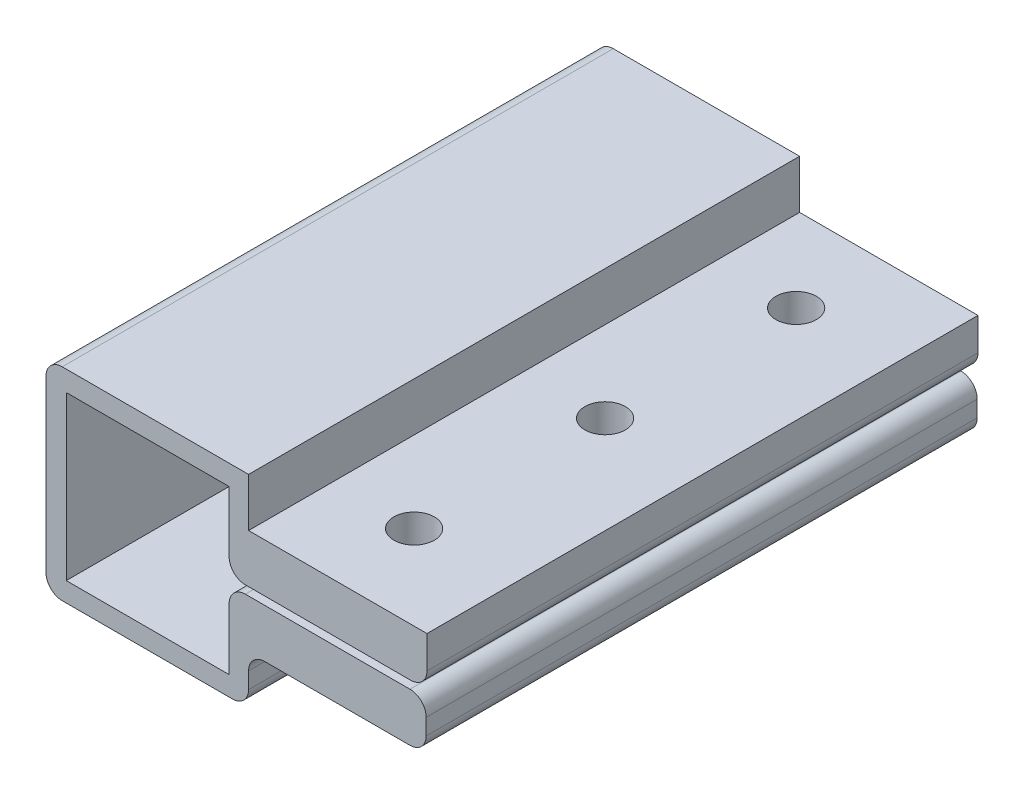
ISO-10303-21;
HEADER;
FILE_DESCRIPTION(('STEP AP214'),'2;1');
FILE_NAME('part.step','',(''),(''),'','','');
FILE_SCHEMA(('AUTOMOTIVE_DESIGN { 1 0 10303 214 1 1 1 1 }'));
ENDSEC;
DATA;
#1=APPLICATION_CONTEXT('core data for automotive mechanical design processes');
#2=APPLICATION_PROTOCOL_DEFINITION('international standard','automotive_design',2000,#1);
#3=PRODUCT_CONTEXT('',#1,'mechanical');
#4=PRODUCT('Part','Part','',(#3));
#5=PRODUCT_RELATED_PRODUCT_CATEGORY('part','',(#4));
#6=PRODUCT_DEFINITION_FORMATION('','',#4);
#7=PRODUCT_DEFINITION_CONTEXT('part definition',#1,'design');
#8=PRODUCT_DEFINITION('design','',#6,#7);
#9=PRODUCT_DEFINITION_SHAPE('','',#8);
#10=(LENGTH_UNIT() NAMED_UNIT(*) SI_UNIT(.MILLI.,.METRE.));
#11=(NAMED_UNIT(*) PLANE_ANGLE_UNIT() SI_UNIT($,.RADIAN.));
#12=(NAMED_UNIT(*) SI_UNIT($,.STERADIAN.) SOLID_ANGLE_UNIT());
#13=UNCERTAINTY_MEASURE_WITH_UNIT(LENGTH_MEASURE(1.E-05),#10,'distance_accuracy_value','');
#14=(GEOMETRIC_REPRESENTATION_CONTEXT(3) GLOBAL_UNCERTAINTY_ASSIGNED_CONTEXT((#13)) GLOBAL_UNIT_ASSIGNED_CONTEXT((#10,
#11,#12)) REPRESENTATION_CONTEXT('',''));
#15=CARTESIAN_POINT('',(0.,0.,0.));
#16=DIRECTION('',(0.,0.,1.));
#17=DIRECTION('',(1.,0.,0.));
#18=AXIS2_PLACEMENT_3D('',#15,#16,#17);
#19=CARTESIAN_POINT('',(-214.942156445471,9.19858037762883,-121.250354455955));
#20=DIRECTION('',(1.,0.,0.));
#21=DIRECTION('',(0.,0.,-1.));
#22=AXIS2_PLACEMENT_3D('',#19,#20,#21);
#23=PLANE('',#22);
#24=DIRECTION('',(0.,-1.,0.));
#25=VECTOR('',#24,1.);
#26=CARTESIAN_POINT('',(-214.942156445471,9.19858037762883,-68.0006006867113));
#27=LINE('',#26,#25);
#28=CARTESIAN_POINT('',(-214.942156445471,15.1985803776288,-68.0006006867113));
#29=VERTEX_POINT('',#28);
#30=CARTESIAN_POINT('',(-214.942156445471,9.19858037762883,-68.0006006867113));
#31=VERTEX_POINT('',#30);
#32=EDGE_CURVE('E41',#29,#31,#27,.T.);
#33=ORIENTED_EDGE('',*,*,#32,.F.);
#34=DIRECTION('',(0.,0.,1.));
#35=VECTOR('',#34,1.);
#36=CARTESIAN_POINT('',(-214.942156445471,15.1985803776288,-121.250354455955));
#37=LINE('',#36,#35);
#38=CARTESIAN_POINT('',(-214.942156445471,15.1985803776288,0.));
#39=VERTEX_POINT('',#38);
#40=EDGE_CURVE('E156',#29,#39,#37,.T.);
#41=ORIENTED_EDGE('',*,*,#40,.T.);
#42=DIRECTION('',(0.,1.,0.));
#43=VECTOR('',#42,1.);
#44=CARTESIAN_POINT('',(-214.942156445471,9.19858037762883,0.));
#45=LINE('',#44,#43);
#46=CARTESIAN_POINT('',(-214.942156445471,9.19858037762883,0.));
#47=VERTEX_POINT('',#46);
#48=EDGE_CURVE('E192',#47,#39,#45,.T.);
#49=ORIENTED_EDGE('',*,*,#48,.F.);
#50=DIRECTION('',(0.,0.,1.));
#51=VECTOR('',#50,1.);
#52=CARTESIAN_POINT('',(-214.942156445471,9.19858037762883,-121.250354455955));
#53=LINE('',#52,#51);
#54=EDGE_CURVE('E193',#31,#47,#53,.T.);
#55=ORIENTED_EDGE('',*,*,#54,.F.);
#56=EDGE_LOOP('',(#33,#41,#49,#55));
#57=FACE_BOUND('',#56,.T.);
#58=ADVANCED_FACE('F32',(#57),#23,.T.);
#59=CARTESIAN_POINT('',(-214.942156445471,9.19858037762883,-121.250354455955));
#60=DIRECTION('',(0.,1.,0.));
#61=DIRECTION('',(0.,0.,1.));
#62=AXIS2_PLACEMENT_3D('',#59,#60,#61);
#63=PLANE('',#62);
#64=CARTESIAN_POINT('',(-204.942156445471,9.19858037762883,-10.4255780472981));
#65=DIRECTION('',(0.,1.,0.));
#66=DIRECTION('',(0.,0.,1.));
#67=AXIS2_PLACEMENT_3D('',#64,#65,#66);
#68=CIRCLE('',#67,2.5);
#69=CARTESIAN_POINT('',(-204.942156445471,9.19858037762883,-7.92557804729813));
#70=VERTEX_POINT('',#69);
#71=EDGE_CURVE('E610',#70,#70,#68,.T.);
#72=ORIENTED_EDGE('',*,*,#71,.F.);
#73=EDGE_LOOP('',(#72));
#74=FACE_BOUND('',#73,.T.);
#75=CARTESIAN_POINT('',(-204.942156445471,9.19858037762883,-34.0003003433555));
#76=DIRECTION('',(0.,1.,0.));
#77=DIRECTION('',(0.,0.,1.));
#78=AXIS2_PLACEMENT_3D('',#75,#76,#77);
#79=CIRCLE('',#78,2.49999999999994);
#80=CARTESIAN_POINT('',(-204.942156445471,9.19858037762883,-31.5003003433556));
#81=VERTEX_POINT('',#80);
#82=EDGE_CURVE('E167',#81,#81,#79,.T.);
#83=ORIENTED_EDGE('',*,*,#82,.F.);
#84=EDGE_LOOP('',(#83));
#85=FACE_BOUND('',#84,.T.);
#86=CARTESIAN_POINT('',(-204.942156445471,9.19858037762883,-57.5750226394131));
#87=DIRECTION('',(0.,1.,0.));
#88=DIRECTION('',(0.,0.,1.));
#89=AXIS2_PLACEMENT_3D('',#86,#87,#88);
#90=CIRCLE('',#89,2.50000000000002);
#91=CARTESIAN_POINT('',(-204.942156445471,9.19858037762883,-55.0750226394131));
#92=VERTEX_POINT('',#91);
#93=EDGE_CURVE('E163',#92,#92,#90,.T.);
#94=ORIENTED_EDGE('',*,*,#93,.F.);
#95=EDGE_LOOP('',(#94));
#96=FACE_BOUND('',#95,.T.);
#97=DIRECTION('',(1.,0.,0.));
#98=VECTOR('',#97,1.);
#99=CARTESIAN_POINT('',(-214.942156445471,9.19858037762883,-68.0006006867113));
#100=LINE('',#99,#98);
#101=CARTESIAN_POINT('',(-192.92581591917,9.19858037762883,-68.0006006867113));
#102=VERTEX_POINT('',#101);
#103=EDGE_CURVE('E232',#31,#102,#100,.T.);
#104=ORIENTED_EDGE('',*,*,#103,.F.);
#105=ORIENTED_EDGE('',*,*,#54,.T.);
#106=DIRECTION('',(-1.,0.,0.));
#107=VECTOR('',#106,1.);
#108=CARTESIAN_POINT('',(-214.942156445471,9.19858037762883,0.));
#109=LINE('',#108,#107);
#110=CARTESIAN_POINT('',(-192.92581591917,9.19858037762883,0.));
#111=VERTEX_POINT('',#110);
#112=EDGE_CURVE('E158',#111,#47,#109,.T.);
#113=ORIENTED_EDGE('',*,*,#112,.F.);
#114=DIRECTION('',(0.,0.,1.));
#115=VECTOR('',#114,1.);
#116=CARTESIAN_POINT('',(-192.92581591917,9.19858037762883,-121.250354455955));
#117=LINE('',#116,#115);
#118=EDGE_CURVE('E307',#102,#111,#117,.T.);
#119=ORIENTED_EDGE('',*,*,#118,.F.);
#120=EDGE_LOOP('',(#104,#105,#113,#119));
#121=FACE_BOUND('',#120,.T.);
#122=ADVANCED_FACE('F437',(#74,#85,#96,#121),#63,.T.);
#123=CARTESIAN_POINT('',(-192.92581591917,9.19858037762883,-121.250354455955));
#124=DIRECTION('',(1.,0.,0.));
#125=DIRECTION('',(0.,0.,-1.));
#126=AXIS2_PLACEMENT_3D('',#123,#124,#125);
#127=PLANE('',#126);
#128=DIRECTION('',(0.,-1.,0.));
#129=VECTOR('',#128,1.);
#130=CARTESIAN_POINT('',(-192.92581591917,9.19858037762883,-68.0006006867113));
#131=LINE('',#130,#129);
#132=CARTESIAN_POINT('',(-192.92581591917,5.19858037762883,-68.0006006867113));
#133=VERTEX_POINT('',#132);
#134=EDGE_CURVE('E230',#102,#133,#131,.T.);
#135=ORIENTED_EDGE('',*,*,#134,.F.);
#136=ORIENTED_EDGE('',*,*,#118,.T.);
#137=DIRECTION('',(0.,1.,0.));
#138=VECTOR('',#137,1.);
#139=CARTESIAN_POINT('',(-192.92581591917,9.19858037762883,0.));
#140=LINE('',#139,#138);
#141=CARTESIAN_POINT('',(-192.92581591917,5.19858037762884,0.));
#142=VERTEX_POINT('',#141);
#143=EDGE_CURVE('E300',#142,#111,#140,.T.);
#144=ORIENTED_EDGE('',*,*,#143,.F.);
#145=DIRECTION('',(0.,0.,1.));
#146=VECTOR('',#145,1.);
#147=CARTESIAN_POINT('',(-192.92581591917,5.19858037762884,-121.250354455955));
#148=LINE('',#147,#146);
#149=EDGE_CURVE('E310',#133,#142,#148,.T.);
#150=ORIENTED_EDGE('',*,*,#149,.F.);
#151=EDGE_LOOP('',(#135,#136,#144,#150));
#152=FACE_BOUND('',#151,.T.);
#153=ADVANCED_FACE('F440',(#152),#127,.T.);
#154=CARTESIAN_POINT('',(-194.92581591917,5.19858037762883,-121.250354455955));
#155=DIRECTION('',(0.,0.,1.));
#156=DIRECTION('',(1.,0.,0.));
#157=AXIS2_PLACEMENT_3D('',#154,#155,#156);
#158=CYLINDRICAL_SURFACE('',#157,2.);
#159=CARTESIAN_POINT('',(-194.92581591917,5.19858037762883,-68.0006006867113));
#160=DIRECTION('',(0.,0.,1.));
#161=DIRECTION('',(1.,0.,0.));
#162=AXIS2_PLACEMENT_3D('',#159,#160,#161);
#163=CIRCLE('',#162,2.);
#164=CARTESIAN_POINT('',(-194.92581591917,3.19858037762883,-68.0006006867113));
#165=VERTEX_POINT('',#164);
#166=EDGE_CURVE('E228',#133,#165,#163,.F.);
#167=ORIENTED_EDGE('',*,*,#166,.F.);
#168=ORIENTED_EDGE('',*,*,#149,.T.);
#169=CARTESIAN_POINT('',(-194.92581591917,5.19858037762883,0.));
#170=DIRECTION('',(0.,0.,1.));
#171=DIRECTION('',(1.,0.,0.));
#172=AXIS2_PLACEMENT_3D('',#169,#170,#171);
#173=CIRCLE('',#172,2.);
#174=CARTESIAN_POINT('',(-194.92581591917,3.19858037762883,0.));
#175=VERTEX_POINT('',#174);
#176=EDGE_CURVE('E297',#175,#142,#173,.T.);
#177=ORIENTED_EDGE('',*,*,#176,.F.);
#178=DIRECTION('',(0.,0.,1.));
#179=VECTOR('',#178,1.);
#180=CARTESIAN_POINT('',(-194.92581591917,3.19858037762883,-121.250354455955));
#181=LINE('',#180,#179);
#182=EDGE_CURVE('E313',#165,#175,#181,.T.);
#183=ORIENTED_EDGE('',*,*,#182,.F.);
#184=EDGE_LOOP('',(#167,#168,#177,#183));
#185=FACE_BOUND('',#184,.T.);
#186=ADVANCED_FACE('F446',(#185),#158,.T.);
#187=CARTESIAN_POINT('',(-215.342156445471,3.19858037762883,-121.250354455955));
#188=DIRECTION('',(0.,-1.,0.));
#189=DIRECTION('',(0.,0.,-1.));
#190=AXIS2_PLACEMENT_3D('',#187,#188,#189);
#191=PLANE('',#190);
#192=CARTESIAN_POINT('',(-204.942156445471,3.19858037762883,-10.4255780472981));
#193=DIRECTION('',(0.,-1.,0.));
#194=DIRECTION('',(0.,0.,-1.));
#195=AXIS2_PLACEMENT_3D('',#192,#193,#194);
#196=CIRCLE('',#195,2.5);
#197=CARTESIAN_POINT('',(-204.942156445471,3.19858037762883,-12.9255780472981));
#198=VERTEX_POINT('',#197);
#199=EDGE_CURVE('E174',#198,#198,#196,.T.);
#200=ORIENTED_EDGE('',*,*,#199,.F.);
#201=EDGE_LOOP('',(#200));
#202=FACE_BOUND('',#201,.T.);
#203=CARTESIAN_POINT('',(-204.942156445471,3.19858037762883,-34.0003003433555));
#204=DIRECTION('',(0.,-1.,0.));
#205=DIRECTION('',(0.,0.,-1.));
#206=AXIS2_PLACEMENT_3D('',#203,#204,#205);
#207=CIRCLE('',#206,2.49999999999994);
#208=CARTESIAN_POINT('',(-204.942156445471,3.19858037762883,-36.5003003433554));
#209=VERTEX_POINT('',#208);
#210=EDGE_CURVE('E171',#209,#209,#207,.T.);
#211=ORIENTED_EDGE('',*,*,#210,.F.);
#212=EDGE_LOOP('',(#211));
#213=FACE_BOUND('',#212,.T.);
#214=CARTESIAN_POINT('',(-204.942156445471,3.19858037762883,-57.5750226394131));
#215=DIRECTION('',(0.,-1.,0.));
#216=DIRECTION('',(0.,0.,-1.));
#217=AXIS2_PLACEMENT_3D('',#214,#215,#216);
#218=CIRCLE('',#217,2.50000000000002);
#219=CARTESIAN_POINT('',(-204.942156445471,3.19858037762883,-60.0750226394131));
#220=VERTEX_POINT('',#219);
#221=EDGE_CURVE('E189',#220,#220,#218,.T.);
#222=ORIENTED_EDGE('',*,*,#221,.F.);
#223=EDGE_LOOP('',(#222));
#224=FACE_BOUND('',#223,.T.);
#225=DIRECTION('',(-1.,0.,0.));
#226=VECTOR('',#225,1.);
#227=CARTESIAN_POINT('',(-215.342156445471,3.19858037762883,-68.0006006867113));
#228=LINE('',#227,#226);
#229=CARTESIAN_POINT('',(-215.342156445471,3.19858037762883,-68.0006006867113));
#230=VERTEX_POINT('',#229);
#231=EDGE_CURVE('E226',#165,#230,#228,.T.);
#232=ORIENTED_EDGE('',*,*,#231,.F.);
#233=ORIENTED_EDGE('',*,*,#182,.T.);
#234=DIRECTION('',(1.,0.,0.));
#235=VECTOR('',#234,1.);
#236=CARTESIAN_POINT('',(-215.342156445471,3.19858037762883,0.));
#237=LINE('',#236,#235);
#238=CARTESIAN_POINT('',(-215.342156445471,3.19858037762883,0.));
#239=VERTEX_POINT('',#238);
#240=EDGE_CURVE('E294',#239,#175,#237,.T.);
#241=ORIENTED_EDGE('',*,*,#240,.F.);
#242=DIRECTION('',(0.,0.,1.));
#243=VECTOR('',#242,1.);
#244=CARTESIAN_POINT('',(-215.342156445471,3.19858037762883,-121.250354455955));
#245=LINE('',#244,#243);
#246=EDGE_CURVE('E316',#230,#239,#245,.T.);
#247=ORIENTED_EDGE('',*,*,#246,.F.);
#248=EDGE_LOOP('',(#232,#233,#241,#247));
#249=FACE_BOUND('',#248,.T.);
#250=ADVANCED_FACE('F450',(#202,#213,#224,#249),#191,.T.);
#251=CARTESIAN_POINT('',(-215.342156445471,5.19858037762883,-121.250354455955));
#252=DIRECTION('',(0.,0.,1.));
#253=DIRECTION('',(1.,0.,0.));
#254=AXIS2_PLACEMENT_3D('',#251,#252,#253);
#255=CYLINDRICAL_SURFACE('',#254,2.);
#256=CARTESIAN_POINT('',(-215.342156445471,5.19858037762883,-68.0006006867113));
#257=DIRECTION('',(0.,0.,1.));
#258=DIRECTION('',(1.,0.,0.));
#259=AXIS2_PLACEMENT_3D('',#256,#257,#258);
#260=CIRCLE('',#259,2.);
#261=CARTESIAN_POINT('',(-217.342156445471,5.19858037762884,-68.0006006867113));
#262=VERTEX_POINT('',#261);
#263=EDGE_CURVE('E224',#230,#262,#260,.F.);
#264=ORIENTED_EDGE('',*,*,#263,.F.);
#265=ORIENTED_EDGE('',*,*,#246,.T.);
#266=CARTESIAN_POINT('',(-215.342156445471,5.19858037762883,0.));
#267=DIRECTION('',(0.,0.,1.));
#268=DIRECTION('',(-1.,0.,0.));
#269=AXIS2_PLACEMENT_3D('',#266,#267,#268);
#270=CIRCLE('',#269,2.);
#271=CARTESIAN_POINT('',(-217.342156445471,5.19858037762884,0.));
#272=VERTEX_POINT('',#271);
#273=EDGE_CURVE('E291',#272,#239,#270,.T.);
#274=ORIENTED_EDGE('',*,*,#273,.F.);
#275=DIRECTION('',(0.,0.,1.));
#276=VECTOR('',#275,1.);
#277=CARTESIAN_POINT('',(-217.342156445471,5.19858037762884,-121.250354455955));
#278=LINE('',#277,#276);
#279=EDGE_CURVE('E319',#262,#272,#278,.T.);
#280=ORIENTED_EDGE('',*,*,#279,.F.);
#281=EDGE_LOOP('',(#264,#265,#274,#280));
#282=FACE_BOUND('',#281,.T.);
#283=ADVANCED_FACE('F456',(#282),#255,.T.);
#284=CARTESIAN_POINT('',(-217.342156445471,5.19858037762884,-121.250354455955));
#285=DIRECTION('',(-1.,0.,0.));
#286=DIRECTION('',(0.,0.,1.));
#287=AXIS2_PLACEMENT_3D('',#284,#285,#286);
#288=PLANE('',#287);
#289=DIRECTION('',(0.,1.,0.));
#290=VECTOR('',#289,1.);
#291=CARTESIAN_POINT('',(-217.342156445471,5.19858037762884,-68.0006006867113));
#292=LINE('',#291,#290);
#293=CARTESIAN_POINT('',(-217.342156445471,12.6985803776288,-68.0006006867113));
#294=VERTEX_POINT('',#293);
#295=EDGE_CURVE('E222',#262,#294,#292,.T.);
#296=ORIENTED_EDGE('',*,*,#295,.F.);
#297=ORIENTED_EDGE('',*,*,#279,.T.);
#298=DIRECTION('',(0.,-1.,0.));
#299=VECTOR('',#298,1.);
#300=CARTESIAN_POINT('',(-217.342156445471,5.19858037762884,0.));
#301=LINE('',#300,#299);
#302=CARTESIAN_POINT('',(-217.342156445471,12.6985803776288,0.));
#303=VERTEX_POINT('',#302);
#304=EDGE_CURVE('E288',#303,#272,#301,.T.);
#305=ORIENTED_EDGE('',*,*,#304,.F.);
#306=DIRECTION('',(0.,0.,1.));
#307=VECTOR('',#306,1.);
#308=CARTESIAN_POINT('',(-217.342156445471,12.6985803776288,-121.250354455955));
#309=LINE('',#308,#307);
#310=EDGE_CURVE('E322',#294,#303,#309,.T.);
#311=ORIENTED_EDGE('',*,*,#310,.F.);
#312=EDGE_LOOP('',(#296,#297,#305,#311));
#313=FACE_BOUND('',#312,.T.);
#314=ADVANCED_FACE('F460',(#313),#288,.T.);
#315=CARTESIAN_POINT('',(-237.442156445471,12.6985803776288,-121.250354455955));
#316=DIRECTION('',(0.,-1.,0.));
#317=DIRECTION('',(0.,0.,-1.));
#318=AXIS2_PLACEMENT_3D('',#315,#316,#317);
#319=PLANE('',#318);
#320=DIRECTION('',(-1.,0.,0.));
#321=VECTOR('',#320,1.);
#322=CARTESIAN_POINT('',(-237.442156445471,12.6985803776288,-68.0006006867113));
#323=LINE('',#322,#321);
#324=CARTESIAN_POINT('',(-237.442156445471,12.6985803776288,-68.0006006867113));
#325=VERTEX_POINT('',#324);
#326=EDGE_CURVE('E220',#294,#325,#323,.T.);
#327=ORIENTED_EDGE('',*,*,#326,.F.);
#328=ORIENTED_EDGE('',*,*,#310,.T.);
#329=DIRECTION('',(1.,0.,0.));
#330=VECTOR('',#329,1.);
#331=CARTESIAN_POINT('',(-237.442156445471,12.6985803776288,0.));
#332=LINE('',#331,#330);
#333=CARTESIAN_POINT('',(-237.442156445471,12.6985803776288,0.));
#334=VERTEX_POINT('',#333);
#335=EDGE_CURVE('E285',#334,#303,#332,.T.);
#336=ORIENTED_EDGE('',*,*,#335,.F.);
#337=DIRECTION('',(0.,0.,1.));
#338=VECTOR('',#337,1.);
#339=CARTESIAN_POINT('',(-237.442156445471,12.6985803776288,-121.250354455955));
#340=LINE('',#339,#338);
#341=EDGE_CURVE('E325',#325,#334,#340,.T.);
#342=ORIENTED_EDGE('',*,*,#341,.F.);
#343=EDGE_LOOP('',(#327,#328,#336,#342));
#344=FACE_BOUND('',#343,.T.);
#345=ADVANCED_FACE('F466',(#344),#319,.T.);
#346=CARTESIAN_POINT('',(-237.442156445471,-7.40141962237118,-121.250354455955));
#347=DIRECTION('',(1.,0.,0.));
#348=DIRECTION('',(0.,0.,-1.));
#349=AXIS2_PLACEMENT_3D('',#346,#347,#348);
#350=PLANE('',#349);
#351=DIRECTION('',(0.,-1.,0.));
#352=VECTOR('',#351,1.);
#353=CARTESIAN_POINT('',(-237.442156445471,-7.40141962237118,-68.0006006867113));
#354=LINE('',#353,#352);
#355=CARTESIAN_POINT('',(-237.442156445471,-7.40141962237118,-68.0006006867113));
#356=VERTEX_POINT('',#355);
#357=EDGE_CURVE('E218',#325,#356,#354,.T.);
#358=ORIENTED_EDGE('',*,*,#357,.F.);
#359=ORIENTED_EDGE('',*,*,#341,.T.);
#360=DIRECTION('',(0.,1.,0.));
#361=VECTOR('',#360,1.);
#362=CARTESIAN_POINT('',(-237.442156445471,-7.40141962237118,0.));
#363=LINE('',#362,#361);
#364=CARTESIAN_POINT('',(-237.442156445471,-7.40141962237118,0.));
#365=VERTEX_POINT('',#364);
#366=EDGE_CURVE('E282',#365,#334,#363,.T.);
#367=ORIENTED_EDGE('',*,*,#366,.F.);
#368=DIRECTION('',(0.,0.,1.));
#369=VECTOR('',#368,1.);
#370=CARTESIAN_POINT('',(-237.442156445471,-7.40141962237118,-121.250354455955));
#371=LINE('',#370,#369);
#372=EDGE_CURVE('E328',#356,#365,#371,.T.);
#373=ORIENTED_EDGE('',*,*,#372,.F.);
#374=EDGE_LOOP('',(#358,#359,#367,#373));
#375=FACE_BOUND('',#374,.T.);
#376=ADVANCED_FACE('F470',(#375),#350,.T.);
#377=CARTESIAN_POINT('',(-237.442156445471,-7.40141962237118,-121.250354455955));
#378=DIRECTION('',(0.,1.,0.));
#379=DIRECTION('',(0.,0.,1.));
#380=AXIS2_PLACEMENT_3D('',#377,#378,#379);
#381=PLANE('',#380);
#382=DIRECTION('',(1.,0.,0.));
#383=VECTOR('',#382,1.);
#384=CARTESIAN_POINT('',(-237.442156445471,-7.40141962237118,-68.0006006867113));
#385=LINE('',#384,#383);
#386=CARTESIAN_POINT('',(-217.342156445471,-7.40141962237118,-68.0006006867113));
#387=VERTEX_POINT('',#386);
#388=EDGE_CURVE('E216',#356,#387,#385,.T.);
#389=ORIENTED_EDGE('',*,*,#388,.F.);
#390=ORIENTED_EDGE('',*,*,#372,.T.);
#391=DIRECTION('',(-1.,0.,0.));
#392=VECTOR('',#391,1.);
#393=CARTESIAN_POINT('',(-237.442156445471,-7.40141962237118,0.));
#394=LINE('',#393,#392);
#395=CARTESIAN_POINT('',(-217.342156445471,-7.40141962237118,0.));
#396=VERTEX_POINT('',#395);
#397=EDGE_CURVE('E279',#396,#365,#394,.T.);
#398=ORIENTED_EDGE('',*,*,#397,.F.);
#399=DIRECTION('',(0.,0.,1.));
#400=VECTOR('',#399,1.);
#401=CARTESIAN_POINT('',(-217.342156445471,-7.40141962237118,-121.250354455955));
#402=LINE('',#401,#400);
#403=EDGE_CURVE('E331',#387,#396,#402,.T.);
#404=ORIENTED_EDGE('',*,*,#403,.F.);
#405=EDGE_LOOP('',(#389,#390,#398,#404));
#406=FACE_BOUND('',#405,.T.);
#407=ADVANCED_FACE('F476',(#406),#381,.T.);
#408=CARTESIAN_POINT('',(-217.342156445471,-7.40141962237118,-121.250354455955));
#409=DIRECTION('',(-1.,0.,0.));
#410=DIRECTION('',(0.,0.,1.));
#411=AXIS2_PLACEMENT_3D('',#408,#409,#410);
#412=PLANE('',#411);
#413=DIRECTION('',(0.,1.,0.));
#414=VECTOR('',#413,1.);
#415=CARTESIAN_POINT('',(-217.342156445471,-7.40141962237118,-68.0006006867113));
#416=LINE('',#415,#414);
#417=CARTESIAN_POINT('',(-217.342156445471,0.198580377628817,-68.0006006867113));
#418=VERTEX_POINT('',#417);
#419=EDGE_CURVE('E214',#387,#418,#416,.T.);
#420=ORIENTED_EDGE('',*,*,#419,.F.);
#421=ORIENTED_EDGE('',*,*,#403,.T.);
#422=DIRECTION('',(0.,-1.,0.));
#423=VECTOR('',#422,1.);
#424=CARTESIAN_POINT('',(-217.342156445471,-7.40141962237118,0.));
#425=LINE('',#424,#423);
#426=CARTESIAN_POINT('',(-217.342156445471,0.198580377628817,0.));
#427=VERTEX_POINT('',#426);
#428=EDGE_CURVE('E276',#427,#396,#425,.T.);
#429=ORIENTED_EDGE('',*,*,#428,.F.);
#430=DIRECTION('',(0.,0.,1.));
#431=VECTOR('',#430,1.);
#432=CARTESIAN_POINT('',(-217.342156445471,0.198580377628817,-121.250354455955));
#433=LINE('',#432,#431);
#434=EDGE_CURVE('E334',#418,#427,#433,.T.);
#435=ORIENTED_EDGE('',*,*,#434,.F.);
#436=EDGE_LOOP('',(#420,#421,#429,#435));
#437=FACE_BOUND('',#436,.T.);
#438=ADVANCED_FACE('F480',(#437),#412,.T.);
#439=CARTESIAN_POINT('',(-215.342156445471,0.198580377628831,-121.250354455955));
#440=DIRECTION('',(0.,0.,1.));
#441=DIRECTION('',(1.,0.,0.));
#442=AXIS2_PLACEMENT_3D('',#439,#440,#441);
#443=CYLINDRICAL_SURFACE('',#442,2.);
#444=CARTESIAN_POINT('',(-215.342156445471,0.198580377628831,-68.0006006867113));
#445=DIRECTION('',(0.,0.,1.));
#446=DIRECTION('',(1.,0.,0.));
#447=AXIS2_PLACEMENT_3D('',#444,#445,#446);
#448=CIRCLE('',#447,2.);
#449=CARTESIAN_POINT('',(-215.342156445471,2.19858037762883,-68.0006006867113));
#450=VERTEX_POINT('',#449);
#451=EDGE_CURVE('E212',#418,#450,#448,.F.);
#452=ORIENTED_EDGE('',*,*,#451,.F.);
#453=ORIENTED_EDGE('',*,*,#434,.T.);
#454=CARTESIAN_POINT('',(-215.342156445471,0.198580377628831,0.));
#455=DIRECTION('',(0.,0.,1.));
#456=DIRECTION('',(1.,0.,0.));
#457=AXIS2_PLACEMENT_3D('',#454,#455,#456);
#458=CIRCLE('',#457,2.);
#459=CARTESIAN_POINT('',(-215.342156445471,2.19858037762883,0.));
#460=VERTEX_POINT('',#459);
#461=EDGE_CURVE('E273',#460,#427,#458,.T.);
#462=ORIENTED_EDGE('',*,*,#461,.F.);
#463=DIRECTION('',(0.,0.,1.));
#464=VECTOR('',#463,1.);
#465=CARTESIAN_POINT('',(-215.342156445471,2.19858037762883,-121.250354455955));
#466=LINE('',#465,#464);
#467=EDGE_CURVE('E337',#450,#460,#466,.T.);
#468=ORIENTED_EDGE('',*,*,#467,.F.);
#469=EDGE_LOOP('',(#452,#453,#462,#468));
#470=FACE_BOUND('',#469,.T.);
#471=ADVANCED_FACE('F486',(#470),#443,.T.);
#472=CARTESIAN_POINT('',(-215.342156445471,2.19858037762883,-121.250354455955));
#473=DIRECTION('',(0.,1.,0.));
#474=DIRECTION('',(0.,0.,1.));
#475=AXIS2_PLACEMENT_3D('',#472,#473,#474);
#476=PLANE('',#475);
#477=CARTESIAN_POINT('',(-204.942156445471,2.19858037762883,-10.4255780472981));
#478=DIRECTION('',(0.,1.,0.));
#479=DIRECTION('',(0.,0.,1.));
#480=AXIS2_PLACEMENT_3D('',#477,#478,#479);
#481=CIRCLE('',#480,2.5);
#482=CARTESIAN_POINT('',(-204.942156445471,2.19858037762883,-7.92557804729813));
#483=VERTEX_POINT('',#482);
#484=EDGE_CURVE('E179',#483,#483,#481,.T.);
#485=ORIENTED_EDGE('',*,*,#484,.F.);
#486=EDGE_LOOP('',(#485));
#487=FACE_BOUND('',#486,.T.);
#488=CARTESIAN_POINT('',(-204.942156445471,2.19858037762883,-34.0003003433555));
#489=DIRECTION('',(0.,1.,0.));
#490=DIRECTION('',(0.,0.,1.));
#491=AXIS2_PLACEMENT_3D('',#488,#489,#490);
#492=CIRCLE('',#491,2.49999999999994);
#493=CARTESIAN_POINT('',(-204.942156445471,2.19858037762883,-31.5003003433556));
#494=VERTEX_POINT('',#493);
#495=EDGE_CURVE('E166',#494,#494,#492,.T.);
#496=ORIENTED_EDGE('',*,*,#495,.F.);
#497=EDGE_LOOP('',(#496));
#498=FACE_BOUND('',#497,.T.);
#499=CARTESIAN_POINT('',(-204.942156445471,2.19858037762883,-57.5750226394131));
#500=DIRECTION('',(0.,1.,0.));
#501=DIRECTION('',(0.,0.,1.));
#502=AXIS2_PLACEMENT_3D('',#499,#500,#501);
#503=CIRCLE('',#502,2.50000000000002);
#504=CARTESIAN_POINT('',(-204.942156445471,2.19858037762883,-55.0750226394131));
#505=VERTEX_POINT('',#504);
#506=EDGE_CURVE('E162',#505,#505,#503,.T.);
#507=ORIENTED_EDGE('',*,*,#506,.F.);
#508=EDGE_LOOP('',(#507));
#509=FACE_BOUND('',#508,.T.);
#510=DIRECTION('',(1.,0.,0.));
#511=VECTOR('',#510,1.);
#512=CARTESIAN_POINT('',(-215.342156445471,2.19858037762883,-68.0006006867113));
#513=LINE('',#512,#511);
#514=CARTESIAN_POINT('',(-195.02581591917,2.19858037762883,-68.0006006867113));
#515=VERTEX_POINT('',#514);
#516=EDGE_CURVE('E210',#450,#515,#513,.T.);
#517=ORIENTED_EDGE('',*,*,#516,.F.);
#518=ORIENTED_EDGE('',*,*,#467,.T.);
#519=DIRECTION('',(-1.,0.,0.));
#520=VECTOR('',#519,1.);
#521=CARTESIAN_POINT('',(-215.342156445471,2.19858037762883,0.));
#522=LINE('',#521,#520);
#523=CARTESIAN_POINT('',(-195.02581591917,2.19858037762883,0.));
#524=VERTEX_POINT('',#523);
#525=EDGE_CURVE('E270',#524,#460,#522,.T.);
#526=ORIENTED_EDGE('',*,*,#525,.F.);
#527=DIRECTION('',(0.,0.,1.));
#528=VECTOR('',#527,1.);
#529=CARTESIAN_POINT('',(-195.02581591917,2.19858037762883,-121.250354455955));
#530=LINE('',#529,#528);
#531=EDGE_CURVE('E340',#515,#524,#530,.T.);
#532=ORIENTED_EDGE('',*,*,#531,.F.);
#533=EDGE_LOOP('',(#517,#518,#526,#532));
#534=FACE_BOUND('',#533,.T.);
#535=ADVANCED_FACE('F490',(#487,#498,#509,#534),#476,.T.);
#536=CARTESIAN_POINT('',(-195.02581591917,0.198580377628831,-121.250354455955));
#537=DIRECTION('',(0.,0.,1.));
#538=DIRECTION('',(1.,0.,0.));
#539=AXIS2_PLACEMENT_3D('',#536,#537,#538);
#540=CYLINDRICAL_SURFACE('',#539,2.);
#541=CARTESIAN_POINT('',(-195.02581591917,0.198580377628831,-68.0006006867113));
#542=DIRECTION('',(0.,0.,1.));
#543=DIRECTION('',(1.,0.,0.));
#544=AXIS2_PLACEMENT_3D('',#541,#542,#543);
#545=CIRCLE('',#544,2.);
#546=CARTESIAN_POINT('',(-193.02581591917,0.198580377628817,-68.0006006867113));
#547=VERTEX_POINT('',#546);
#548=EDGE_CURVE('E208',#515,#547,#545,.F.);
#549=ORIENTED_EDGE('',*,*,#548,.F.);
#550=ORIENTED_EDGE('',*,*,#531,.T.);
#551=CARTESIAN_POINT('',(-195.02581591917,0.198580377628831,0.));
#552=DIRECTION('',(0.,0.,1.));
#553=DIRECTION('',(1.,0.,0.));
#554=AXIS2_PLACEMENT_3D('',#551,#552,#553);
#555=CIRCLE('',#554,2.);
#556=CARTESIAN_POINT('',(-193.02581591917,0.198580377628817,0.));
#557=VERTEX_POINT('',#556);
#558=EDGE_CURVE('E267',#557,#524,#555,.T.);
#559=ORIENTED_EDGE('',*,*,#558,.F.);
#560=DIRECTION('',(0.,0.,1.));
#561=VECTOR('',#560,1.);
#562=CARTESIAN_POINT('',(-193.02581591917,0.198580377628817,-121.250354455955));
#563=LINE('',#562,#561);
#564=EDGE_CURVE('E343',#547,#557,#563,.T.);
#565=ORIENTED_EDGE('',*,*,#564,.F.);
#566=EDGE_LOOP('',(#549,#550,#559,#565));
#567=FACE_BOUND('',#566,.T.);
#568=ADVANCED_FACE('F496',(#567),#540,.T.);
#569=CARTESIAN_POINT('',(-193.02581591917,0.198580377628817,-121.250354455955));
#570=DIRECTION('',(1.,0.,0.));
#571=DIRECTION('',(0.,0.,-1.));
#572=AXIS2_PLACEMENT_3D('',#569,#570,#571);
#573=PLANE('',#572);
#574=DIRECTION('',(0.,-1.,0.));
#575=VECTOR('',#574,1.);
#576=CARTESIAN_POINT('',(-193.02581591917,0.198580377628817,-68.0006006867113));
#577=LINE('',#576,#575);
#578=CARTESIAN_POINT('',(-193.02581591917,-1.80141962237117,-68.0006006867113));
#579=VERTEX_POINT('',#578);
#580=EDGE_CURVE('E206',#547,#579,#577,.T.);
#581=ORIENTED_EDGE('',*,*,#580,.F.);
#582=ORIENTED_EDGE('',*,*,#564,.T.);
#583=DIRECTION('',(0.,1.,0.));
#584=VECTOR('',#583,1.);
#585=CARTESIAN_POINT('',(-193.02581591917,0.198580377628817,0.));
#586=LINE('',#585,#584);
#587=CARTESIAN_POINT('',(-193.02581591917,-1.80141962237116,0.));
#588=VERTEX_POINT('',#587);
#589=EDGE_CURVE('E264',#588,#557,#586,.T.);
#590=ORIENTED_EDGE('',*,*,#589,.F.);
#591=DIRECTION('',(0.,0.,1.));
#592=VECTOR('',#591,1.);
#593=CARTESIAN_POINT('',(-193.02581591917,-1.80141962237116,-121.250354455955));
#594=LINE('',#593,#592);
#595=EDGE_CURVE('E346',#579,#588,#594,.T.);
#596=ORIENTED_EDGE('',*,*,#595,.F.);
#597=EDGE_LOOP('',(#581,#582,#590,#596));
#598=FACE_BOUND('',#597,.T.);
#599=ADVANCED_FACE('F500',(#598),#573,.T.);
#600=CARTESIAN_POINT('',(-195.02581591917,-1.80141962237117,-121.250354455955));
#601=DIRECTION('',(0.,0.,1.));
#602=DIRECTION('',(1.,0.,0.));
#603=AXIS2_PLACEMENT_3D('',#600,#601,#602);
#604=CYLINDRICAL_SURFACE('',#603,2.);
#605=CARTESIAN_POINT('',(-195.02581591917,-1.80141962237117,-68.0006006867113));
#606=DIRECTION('',(0.,0.,1.));
#607=DIRECTION('',(1.,0.,0.));
#608=AXIS2_PLACEMENT_3D('',#605,#606,#607);
#609=CIRCLE('',#608,2.);
#610=CARTESIAN_POINT('',(-195.02581591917,-3.80141962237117,-68.0006006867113));
#611=VERTEX_POINT('',#610);
#612=EDGE_CURVE('E204',#579,#611,#609,.F.);
#613=ORIENTED_EDGE('',*,*,#612,.F.);
#614=ORIENTED_EDGE('',*,*,#595,.T.);
#615=CARTESIAN_POINT('',(-195.02581591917,-1.80141962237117,0.));
#616=DIRECTION('',(0.,0.,1.));
#617=DIRECTION('',(1.,0.,0.));
#618=AXIS2_PLACEMENT_3D('',#615,#616,#617);
#619=CIRCLE('',#618,2.);
#620=CARTESIAN_POINT('',(-195.02581591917,-3.80141962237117,0.));
#621=VERTEX_POINT('',#620);
#622=EDGE_CURVE('E261',#621,#588,#619,.T.);
#623=ORIENTED_EDGE('',*,*,#622,.F.);
#624=DIRECTION('',(0.,0.,1.));
#625=VECTOR('',#624,1.);
#626=CARTESIAN_POINT('',(-195.02581591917,-3.80141962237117,-121.250354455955));
#627=LINE('',#626,#625);
#628=EDGE_CURVE('E349',#611,#621,#627,.T.);
#629=ORIENTED_EDGE('',*,*,#628,.F.);
#630=EDGE_LOOP('',(#613,#614,#623,#629));
#631=FACE_BOUND('',#630,.T.);
#632=ADVANCED_FACE('F506',(#631),#604,.T.);
#633=CARTESIAN_POINT('',(-212.942156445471,-3.80141962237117,-121.250354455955));
#634=DIRECTION('',(0.,-1.,0.));
#635=DIRECTION('',(0.,0.,-1.));
#636=AXIS2_PLACEMENT_3D('',#633,#634,#635);
#637=PLANE('',#636);
#638=CARTESIAN_POINT('',(-204.942156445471,-3.80141962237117,-10.4255780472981));
#639=DIRECTION('',(0.,-1.,0.));
#640=DIRECTION('',(0.,0.,-1.));
#641=AXIS2_PLACEMENT_3D('',#638,#639,#640);
#642=CIRCLE('',#641,2.5);
#643=CARTESIAN_POINT('',(-204.942156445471,-3.80141962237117,-12.9255780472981));
#644=VERTEX_POINT('',#643);
#645=EDGE_CURVE('E35',#644,#644,#642,.T.);
#646=ORIENTED_EDGE('',*,*,#645,.F.);
#647=EDGE_LOOP('',(#646));
#648=FACE_BOUND('',#647,.T.);
#649=CARTESIAN_POINT('',(-204.942156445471,-3.80141962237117,-34.0003003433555));
#650=DIRECTION('',(0.,-1.,0.));
#651=DIRECTION('',(0.,0.,-1.));
#652=AXIS2_PLACEMENT_3D('',#649,#650,#651);
#653=CIRCLE('',#652,2.49999999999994);
#654=CARTESIAN_POINT('',(-204.942156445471,-3.80141962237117,-36.5003003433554));
#655=VERTEX_POINT('',#654);
#656=EDGE_CURVE('E164',#655,#655,#653,.T.);
#657=ORIENTED_EDGE('',*,*,#656,.F.);
#658=EDGE_LOOP('',(#657));
#659=FACE_BOUND('',#658,.T.);
#660=CARTESIAN_POINT('',(-204.942156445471,-3.80141962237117,-57.5750226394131));
#661=DIRECTION('',(0.,-1.,0.));
#662=DIRECTION('',(0.,0.,-1.));
#663=AXIS2_PLACEMENT_3D('',#660,#661,#662);
#664=CIRCLE('',#663,2.50000000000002);
#665=CARTESIAN_POINT('',(-204.942156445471,-3.80141962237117,-60.0750226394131));
#666=VERTEX_POINT('',#665);
#667=EDGE_CURVE('E160',#666,#666,#664,.T.);
#668=ORIENTED_EDGE('',*,*,#667,.F.);
#669=EDGE_LOOP('',(#668));
#670=FACE_BOUND('',#669,.T.);
#671=DIRECTION('',(-1.,0.,0.));
#672=VECTOR('',#671,1.);
#673=CARTESIAN_POINT('',(-212.942156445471,-3.80141962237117,-68.0006006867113));
#674=LINE('',#673,#672);
#675=CARTESIAN_POINT('',(-212.942156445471,-3.80141962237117,-68.0006006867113));
#676=VERTEX_POINT('',#675);
#677=EDGE_CURVE('E202',#611,#676,#674,.T.);
#678=ORIENTED_EDGE('',*,*,#677,.F.);
#679=ORIENTED_EDGE('',*,*,#628,.T.);
#680=DIRECTION('',(1.,0.,0.));
#681=VECTOR('',#680,1.);
#682=CARTESIAN_POINT('',(-212.942156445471,-3.80141962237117,0.));
#683=LINE('',#682,#681);
#684=CARTESIAN_POINT('',(-212.942156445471,-3.80141962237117,0.));
#685=VERTEX_POINT('',#684);
#686=EDGE_CURVE('E258',#685,#621,#683,.T.);
#687=ORIENTED_EDGE('',*,*,#686,.F.);
#688=DIRECTION('',(0.,0.,1.));
#689=VECTOR('',#688,1.);
#690=CARTESIAN_POINT('',(-212.942156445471,-3.80141962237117,-121.250354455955));
#691=LINE('',#690,#689);
#692=EDGE_CURVE('E352',#676,#685,#691,.T.);
#693=ORIENTED_EDGE('',*,*,#692,.F.);
#694=EDGE_LOOP('',(#678,#679,#687,#693));
#695=FACE_BOUND('',#694,.T.);
#696=ADVANCED_FACE('F510',(#648,#659,#670,#695),#637,.T.);
#697=CARTESIAN_POINT('',(-212.942156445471,-5.80141962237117,-121.250354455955));
#698=DIRECTION('',(0.,0.,1.));
#699=DIRECTION('',(1.,0.,0.));
#700=AXIS2_PLACEMENT_3D('',#697,#698,#699);
#701=CYLINDRICAL_SURFACE('',#700,2.);
#702=CARTESIAN_POINT('',(-212.942156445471,-5.80141962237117,-68.0006006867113));
#703=DIRECTION('',(0.,0.,1.));
#704=DIRECTION('',(1.,0.,0.));
#705=AXIS2_PLACEMENT_3D('',#702,#703,#704);
#706=CIRCLE('',#705,2.);
#707=CARTESIAN_POINT('',(-214.942156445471,-5.80141962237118,-68.0006006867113));
#708=VERTEX_POINT('',#707);
#709=EDGE_CURVE('E200',#676,#708,#706,.T.);
#710=ORIENTED_EDGE('',*,*,#709,.F.);
#711=ORIENTED_EDGE('',*,*,#692,.T.);
#712=CARTESIAN_POINT('',(-212.942156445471,-5.80141962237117,0.));
#713=DIRECTION('',(0.,0.,-1.));
#714=DIRECTION('',(1.,0.,0.));
#715=AXIS2_PLACEMENT_3D('',#712,#713,#714);
#716=CIRCLE('',#715,2.);
#717=CARTESIAN_POINT('',(-214.942156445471,-5.80141962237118,0.));
#718=VERTEX_POINT('',#717);
#719=EDGE_CURVE('E255',#718,#685,#716,.T.);
#720=ORIENTED_EDGE('',*,*,#719,.F.);
#721=DIRECTION('',(0.,0.,1.));
#722=VECTOR('',#721,1.);
#723=CARTESIAN_POINT('',(-214.942156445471,-5.80141962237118,-121.250354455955));
#724=LINE('',#723,#722);
#725=EDGE_CURVE('E355',#708,#718,#724,.T.);
#726=ORIENTED_EDGE('',*,*,#725,.F.);
#727=EDGE_LOOP('',(#710,#711,#720,#726));
#728=FACE_BOUND('',#727,.T.);
#729=ADVANCED_FACE('F516',(#728),#701,.F.);
#730=CARTESIAN_POINT('',(-214.942156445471,-7.80141962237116,-121.250354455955));
#731=DIRECTION('',(1.,0.,0.));
#732=DIRECTION('',(0.,0.,-1.));
#733=AXIS2_PLACEMENT_3D('',#730,#731,#732);
#734=PLANE('',#733);
#735=DIRECTION('',(0.,-1.,0.));
#736=VECTOR('',#735,1.);
#737=CARTESIAN_POINT('',(-214.942156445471,-7.80141962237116,-68.0006006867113));
#738=LINE('',#737,#736);
#739=CARTESIAN_POINT('',(-214.942156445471,-7.80141962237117,-68.0006006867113));
#740=VERTEX_POINT('',#739);
#741=EDGE_CURVE('E198',#708,#740,#738,.T.);
#742=ORIENTED_EDGE('',*,*,#741,.F.);
#743=ORIENTED_EDGE('',*,*,#725,.T.);
#744=DIRECTION('',(0.,1.,0.));
#745=VECTOR('',#744,1.);
#746=CARTESIAN_POINT('',(-214.942156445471,-7.80141962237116,0.));
#747=LINE('',#746,#745);
#748=CARTESIAN_POINT('',(-214.942156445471,-7.80141962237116,0.));
#749=VERTEX_POINT('',#748);
#750=EDGE_CURVE('E252',#749,#718,#747,.T.);
#751=ORIENTED_EDGE('',*,*,#750,.F.);
#752=DIRECTION('',(0.,0.,1.));
#753=VECTOR('',#752,1.);
#754=CARTESIAN_POINT('',(-214.942156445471,-7.80141962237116,-121.250354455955));
#755=LINE('',#754,#753);
#756=EDGE_CURVE('E358',#740,#749,#755,.T.);
#757=ORIENTED_EDGE('',*,*,#756,.F.);
#758=EDGE_LOOP('',(#742,#743,#751,#757));
#759=FACE_BOUND('',#758,.T.);
#760=ADVANCED_FACE('F519',(#759),#734,.T.);
#761=CARTESIAN_POINT('',(-216.942156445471,-7.80141962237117,-121.250354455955));
#762=DIRECTION('',(0.,0.,1.));
#763=DIRECTION('',(1.,0.,0.));
#764=AXIS2_PLACEMENT_3D('',#761,#762,#763);
#765=CYLINDRICAL_SURFACE('',#764,2.);
#766=CARTESIAN_POINT('',(-216.942156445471,-7.80141962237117,-68.0006006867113));
#767=DIRECTION('',(0.,0.,1.));
#768=DIRECTION('',(1.,0.,0.));
#769=AXIS2_PLACEMENT_3D('',#766,#767,#768);
#770=CIRCLE('',#769,2.);
#771=CARTESIAN_POINT('',(-216.942156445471,-9.80141962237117,-68.0006006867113));
#772=VERTEX_POINT('',#771);
#773=EDGE_CURVE('E196',#740,#772,#770,.F.);
#774=ORIENTED_EDGE('',*,*,#773,.F.);
#775=ORIENTED_EDGE('',*,*,#756,.T.);
#776=CARTESIAN_POINT('',(-216.942156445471,-7.80141962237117,0.));
#777=DIRECTION('',(0.,0.,1.));
#778=DIRECTION('',(1.,0.,0.));
#779=AXIS2_PLACEMENT_3D('',#776,#777,#778);
#780=CIRCLE('',#779,2.);
#781=CARTESIAN_POINT('',(-216.942156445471,-9.80141962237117,0.));
#782=VERTEX_POINT('',#781);
#783=EDGE_CURVE('E249',#782,#749,#780,.T.);
#784=ORIENTED_EDGE('',*,*,#783,.F.);
#785=DIRECTION('',(0.,0.,1.));
#786=VECTOR('',#785,1.);
#787=CARTESIAN_POINT('',(-216.942156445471,-9.80141962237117,-121.250354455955));
#788=LINE('',#787,#786);
#789=EDGE_CURVE('E148',#772,#782,#788,.T.);
#790=ORIENTED_EDGE('',*,*,#789,.F.);
#791=EDGE_LOOP('',(#774,#775,#784,#790));
#792=FACE_BOUND('',#791,.T.);
#793=ADVANCED_FACE('F372',(#792),#765,.T.);
#794=CARTESIAN_POINT('',(-237.942156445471,-9.80141962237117,-121.250354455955));
#795=DIRECTION('',(0.,-1.,0.));
#796=DIRECTION('',(0.,0.,-1.));
#797=AXIS2_PLACEMENT_3D('',#794,#795,#796);
#798=PLANE('',#797);
#799=DIRECTION('',(-1.,0.,0.));
#800=VECTOR('',#799,1.);
#801=CARTESIAN_POINT('',(-237.942156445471,-9.80141962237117,-68.0006006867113));
#802=LINE('',#801,#800);
#803=CARTESIAN_POINT('',(-237.942156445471,-9.80141962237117,-68.0006006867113));
#804=VERTEX_POINT('',#803);
#805=EDGE_CURVE('E124',#772,#804,#802,.T.);
#806=ORIENTED_EDGE('',*,*,#805,.F.);
#807=ORIENTED_EDGE('',*,*,#789,.T.);
#808=DIRECTION('',(1.,0.,0.));
#809=VECTOR('',#808,1.);
#810=CARTESIAN_POINT('',(-237.942156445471,-9.80141962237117,0.));
#811=LINE('',#810,#809);
#812=CARTESIAN_POINT('',(-237.942156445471,-9.80141962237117,0.));
#813=VERTEX_POINT('',#812);
#814=EDGE_CURVE('E246',#813,#782,#811,.T.);
#815=ORIENTED_EDGE('',*,*,#814,.F.);
#816=DIRECTION('',(0.,0.,1.));
#817=VECTOR('',#816,1.);
#818=CARTESIAN_POINT('',(-237.942156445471,-9.80141962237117,-121.250354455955));
#819=LINE('',#818,#817);
#820=EDGE_CURVE('E146',#804,#813,#819,.T.);
#821=ORIENTED_EDGE('',*,*,#820,.F.);
#822=EDGE_LOOP('',(#806,#807,#815,#821));
#823=FACE_BOUND('',#822,.T.);
#824=ADVANCED_FACE('F366',(#823),#798,.T.);
#825=CARTESIAN_POINT('',(-237.942156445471,-7.80141962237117,-121.250354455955));
#826=DIRECTION('',(0.,0.,1.));
#827=DIRECTION('',(1.,0.,0.));
#828=AXIS2_PLACEMENT_3D('',#825,#826,#827);
#829=CYLINDRICAL_SURFACE('',#828,2.);
#830=CARTESIAN_POINT('',(-237.942156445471,-7.80141962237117,-68.0006006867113));
#831=DIRECTION('',(0.,0.,1.));
#832=DIRECTION('',(1.,0.,0.));
#833=AXIS2_PLACEMENT_3D('',#830,#831,#832);
#834=CIRCLE('',#833,2.);
#835=CARTESIAN_POINT('',(-239.942156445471,-7.80141962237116,-68.0006006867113));
#836=VERTEX_POINT('',#835);
#837=EDGE_CURVE('E118',#804,#836,#834,.F.);
#838=ORIENTED_EDGE('',*,*,#837,.F.);
#839=ORIENTED_EDGE('',*,*,#820,.T.);
#840=CARTESIAN_POINT('',(-237.942156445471,-7.80141962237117,0.));
#841=DIRECTION('',(0.,0.,1.));
#842=DIRECTION('',(-1.,0.,0.));
#843=AXIS2_PLACEMENT_3D('',#840,#841,#842);
#844=CIRCLE('',#843,2.);
#845=CARTESIAN_POINT('',(-239.942156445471,-7.80141962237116,0.));
#846=VERTEX_POINT('',#845);
#847=EDGE_CURVE('E144',#846,#813,#844,.T.);
#848=ORIENTED_EDGE('',*,*,#847,.F.);
#849=DIRECTION('',(0.,0.,1.));
#850=VECTOR('',#849,1.);
#851=CARTESIAN_POINT('',(-239.942156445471,-7.80141962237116,-121.250354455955));
#852=LINE('',#851,#850);
#853=EDGE_CURVE('E136',#836,#846,#852,.T.);
#854=ORIENTED_EDGE('',*,*,#853,.F.);
#855=EDGE_LOOP('',(#838,#839,#848,#854));
#856=FACE_BOUND('',#855,.T.);
#857=ADVANCED_FACE('F142',(#856),#829,.T.);
#858=CARTESIAN_POINT('',(-239.942156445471,13.1985803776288,-121.250354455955));
#859=DIRECTION('',(-1.,0.,0.));
#860=DIRECTION('',(0.,0.,1.));
#861=AXIS2_PLACEMENT_3D('',#858,#859,#860);
#862=PLANE('',#861);
#863=DIRECTION('',(0.,1.,0.));
#864=VECTOR('',#863,1.);
#865=CARTESIAN_POINT('',(-239.942156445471,13.1985803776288,-68.0006006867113));
#866=LINE('',#865,#864);
#867=CARTESIAN_POINT('',(-239.942156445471,13.1985803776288,-68.0006006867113));
#868=VERTEX_POINT('',#867);
#869=EDGE_CURVE('E121',#836,#868,#866,.T.);
#870=ORIENTED_EDGE('',*,*,#869,.F.);
#871=ORIENTED_EDGE('',*,*,#853,.T.);
#872=DIRECTION('',(0.,-1.,0.));
#873=VECTOR('',#872,1.);
#874=CARTESIAN_POINT('',(-239.942156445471,13.1985803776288,0.));
#875=LINE('',#874,#873);
#876=CARTESIAN_POINT('',(-239.942156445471,13.1985803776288,0.));
#877=VERTEX_POINT('',#876);
#878=EDGE_CURVE('E243',#877,#846,#875,.T.);
#879=ORIENTED_EDGE('',*,*,#878,.F.);
#880=DIRECTION('',(0.,0.,1.));
#881=VECTOR('',#880,1.);
#882=CARTESIAN_POINT('',(-239.942156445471,13.1985803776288,-121.250354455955));
#883=LINE('',#882,#881);
#884=EDGE_CURVE('E139',#868,#877,#883,.T.);
#885=ORIENTED_EDGE('',*,*,#884,.F.);
#886=EDGE_LOOP('',(#870,#871,#879,#885));
#887=FACE_BOUND('',#886,.T.);
#888=ADVANCED_FACE('F133',(#887),#862,.T.);
#889=CARTESIAN_POINT('',(-237.942156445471,13.1985803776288,-121.250354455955));
#890=DIRECTION('',(0.,0.,1.));
#891=DIRECTION('',(1.,0.,0.));
#892=AXIS2_PLACEMENT_3D('',#889,#890,#891);
#893=CYLINDRICAL_SURFACE('',#892,2.);
#894=CARTESIAN_POINT('',(-237.942156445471,13.1985803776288,-68.0006006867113));
#895=DIRECTION('',(0.,0.,1.));
#896=DIRECTION('',(1.,0.,0.));
#897=AXIS2_PLACEMENT_3D('',#894,#895,#896);
#898=CIRCLE('',#897,2.);
#899=CARTESIAN_POINT('',(-237.942156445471,15.1985803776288,-68.0006006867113));
#900=VERTEX_POINT('',#899);
#901=EDGE_CURVE('E140',#868,#900,#898,.F.);
#902=ORIENTED_EDGE('',*,*,#901,.F.);
#903=ORIENTED_EDGE('',*,*,#884,.T.);
#904=CARTESIAN_POINT('',(-237.942156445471,13.1985803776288,0.));
#905=DIRECTION('',(0.,0.,1.));
#906=DIRECTION('',(1.,0.,0.));
#907=AXIS2_PLACEMENT_3D('',#904,#905,#906);
#908=CIRCLE('',#907,2.);
#909=CARTESIAN_POINT('',(-237.942156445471,15.1985803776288,0.));
#910=VERTEX_POINT('',#909);
#911=EDGE_CURVE('E240',#910,#877,#908,.T.);
#912=ORIENTED_EDGE('',*,*,#911,.F.);
#913=DIRECTION('',(0.,0.,1.));
#914=VECTOR('',#913,1.);
#915=CARTESIAN_POINT('',(-237.942156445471,15.1985803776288,-121.250354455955));
#916=LINE('',#915,#914);
#917=EDGE_CURVE('E150',#900,#910,#916,.T.);
#918=ORIENTED_EDGE('',*,*,#917,.F.);
#919=EDGE_LOOP('',(#902,#903,#912,#918));
#920=FACE_BOUND('',#919,.T.);
#921=ADVANCED_FACE('F425',(#920),#893,.T.);
#922=CARTESIAN_POINT('',(-214.942156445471,15.1985803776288,-121.250354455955));
#923=DIRECTION('',(0.,1.,0.));
#924=DIRECTION('',(-1.,0.,0.));
#925=AXIS2_PLACEMENT_3D('',#922,#923,#924);
#926=PLANE('',#925);
#927=DIRECTION('',(1.,0.,0.));
#928=VECTOR('',#927,1.);
#929=CARTESIAN_POINT('',(-214.942156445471,15.1985803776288,-68.0006006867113));
#930=LINE('',#929,#928);
#931=EDGE_CURVE('E11',#900,#29,#930,.T.);
#932=ORIENTED_EDGE('',*,*,#931,.F.);
#933=ORIENTED_EDGE('',*,*,#917,.T.);
#934=DIRECTION('',(-1.,0.,0.));
#935=VECTOR('',#934,1.);
#936=CARTESIAN_POINT('',(-214.942156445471,15.1985803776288,0.));
#937=LINE('',#936,#935);
#938=EDGE_CURVE('E237',#39,#910,#937,.T.);
#939=ORIENTED_EDGE('',*,*,#938,.F.);
#940=ORIENTED_EDGE('',*,*,#40,.F.);
#941=EDGE_LOOP('',(#932,#933,#939,#940));
#942=FACE_BOUND('',#941,.T.);
#943=ADVANCED_FACE('F430',(#942),#926,.T.);
#944=CARTESIAN_POINT('',(-237.942156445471,13.1985803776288,0.));
#945=DIRECTION('',(0.,0.,1.));
#946=DIRECTION('',(1.,0.,0.));
#947=AXIS2_PLACEMENT_3D('',#944,#945,#946);
#948=PLANE('',#947);
#949=ORIENTED_EDGE('',*,*,#48,.T.);
#950=ORIENTED_EDGE('',*,*,#938,.T.);
#951=ORIENTED_EDGE('',*,*,#911,.T.);
#952=ORIENTED_EDGE('',*,*,#878,.T.);
#953=ORIENTED_EDGE('',*,*,#847,.T.);
#954=ORIENTED_EDGE('',*,*,#814,.T.);
#955=ORIENTED_EDGE('',*,*,#783,.T.);
#956=ORIENTED_EDGE('',*,*,#750,.T.);
#957=ORIENTED_EDGE('',*,*,#719,.T.);
#958=ORIENTED_EDGE('',*,*,#686,.T.);
#959=ORIENTED_EDGE('',*,*,#622,.T.);
#960=ORIENTED_EDGE('',*,*,#589,.T.);
#961=ORIENTED_EDGE('',*,*,#558,.T.);
#962=ORIENTED_EDGE('',*,*,#525,.T.);
#963=ORIENTED_EDGE('',*,*,#461,.T.);
#964=ORIENTED_EDGE('',*,*,#428,.T.);
#965=ORIENTED_EDGE('',*,*,#397,.T.);
#966=ORIENTED_EDGE('',*,*,#366,.T.);
#967=ORIENTED_EDGE('',*,*,#335,.T.);
#968=ORIENTED_EDGE('',*,*,#304,.T.);
#969=ORIENTED_EDGE('',*,*,#273,.T.);
#970=ORIENTED_EDGE('',*,*,#240,.T.);
#971=ORIENTED_EDGE('',*,*,#176,.T.);
#972=ORIENTED_EDGE('',*,*,#143,.T.);
#973=ORIENTED_EDGE('',*,*,#112,.T.);
#974=EDGE_LOOP('',(#949,#950,#951,#952,#953,#954,#955,#956,#957,#958,#959,#960,#961,#962,#963,
#964,#965,#966,#967,#968,#969,#970,#971,#972,#973));
#975=FACE_BOUND('',#974,.T.);
#976=ADVANCED_FACE('F376',(#975),#948,.T.);
#977=CARTESIAN_POINT('',(-214.942156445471,9.19858037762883,-68.0006006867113));
#978=DIRECTION('',(0.,0.,1.));
#979=DIRECTION('',(0.,-1.,0.));
#980=AXIS2_PLACEMENT_3D('',#977,#978,#979);
#981=PLANE('',#980);
#982=ORIENTED_EDGE('',*,*,#32,.T.);
#983=ORIENTED_EDGE('',*,*,#103,.T.);
#984=ORIENTED_EDGE('',*,*,#134,.T.);
#985=ORIENTED_EDGE('',*,*,#166,.T.);
#986=ORIENTED_EDGE('',*,*,#231,.T.);
#987=ORIENTED_EDGE('',*,*,#263,.T.);
#988=ORIENTED_EDGE('',*,*,#295,.T.);
#989=ORIENTED_EDGE('',*,*,#326,.T.);
#990=ORIENTED_EDGE('',*,*,#357,.T.);
#991=ORIENTED_EDGE('',*,*,#388,.T.);
#992=ORIENTED_EDGE('',*,*,#419,.T.);
#993=ORIENTED_EDGE('',*,*,#451,.T.);
#994=ORIENTED_EDGE('',*,*,#516,.T.);
#995=ORIENTED_EDGE('',*,*,#548,.T.);
#996=ORIENTED_EDGE('',*,*,#580,.T.);
#997=ORIENTED_EDGE('',*,*,#612,.T.);
#998=ORIENTED_EDGE('',*,*,#677,.T.);
#999=ORIENTED_EDGE('',*,*,#709,.T.);
#1000=ORIENTED_EDGE('',*,*,#741,.T.);
#1001=ORIENTED_EDGE('',*,*,#773,.T.);
#1002=ORIENTED_EDGE('',*,*,#805,.T.);
#1003=ORIENTED_EDGE('',*,*,#837,.T.);
#1004=ORIENTED_EDGE('',*,*,#869,.T.);
#1005=ORIENTED_EDGE('',*,*,#901,.T.);
#1006=ORIENTED_EDGE('',*,*,#931,.T.);
#1007=EDGE_LOOP('',(#982,#983,#984,#985,#986,#987,#988,#989,#990,#991,#992,#993,#994,#995,#996,
#997,#998,#999,#1000,#1001,#1002,#1003,#1004,#1005,#1006));
#1008=FACE_BOUND('',#1007,.T.);
#1009=ADVANCED_FACE('F120',(#1008),#981,.F.);
#1010=CARTESIAN_POINT('',(-204.942156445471,-10.8014196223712,-57.5750226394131));
#1011=DIRECTION('',(0.,1.,0.));
#1012=DIRECTION('',(0.,0.,1.));
#1013=AXIS2_PLACEMENT_3D('',#1010,#1011,#1012);
#1014=CYLINDRICAL_SURFACE('',#1013,2.50000000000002);
#1015=ORIENTED_EDGE('',*,*,#506,.T.);
#1016=EDGE_LOOP('',(#1015));
#1017=FACE_BOUND('',#1016,.T.);
#1018=ORIENTED_EDGE('',*,*,#667,.T.);
#1019=EDGE_LOOP('',(#1018));
#1020=FACE_BOUND('',#1019,.T.);
#1021=ADVANCED_FACE('F581',(#1017,#1020),#1014,.F.);
#1022=ORIENTED_EDGE('',*,*,#221,.T.);
#1023=EDGE_LOOP('',(#1022));
#1024=FACE_BOUND('',#1023,.T.);
#1025=ORIENTED_EDGE('',*,*,#93,.T.);
#1026=EDGE_LOOP('',(#1025));
#1027=FACE_BOUND('',#1026,.T.);
#1028=ADVANCED_FACE('F583',(#1024,#1027),#1014,.F.);
#1029=CARTESIAN_POINT('',(-204.942156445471,-10.8014196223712,-34.0003003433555));
#1030=DIRECTION('',(0.,1.,0.));
#1031=DIRECTION('',(0.,0.,1.));
#1032=AXIS2_PLACEMENT_3D('',#1029,#1030,#1031);
#1033=CYLINDRICAL_SURFACE('',#1032,2.49999999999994);
#1034=ORIENTED_EDGE('',*,*,#495,.T.);
#1035=EDGE_LOOP('',(#1034));
#1036=FACE_BOUND('',#1035,.T.);
#1037=ORIENTED_EDGE('',*,*,#656,.T.);
#1038=EDGE_LOOP('',(#1037));
#1039=FACE_BOUND('',#1038,.T.);
#1040=ADVANCED_FACE('F590',(#1036,#1039),#1033,.F.);
#1041=ORIENTED_EDGE('',*,*,#210,.T.);
#1042=EDGE_LOOP('',(#1041));
#1043=FACE_BOUND('',#1042,.T.);
#1044=ORIENTED_EDGE('',*,*,#82,.T.);
#1045=EDGE_LOOP('',(#1044));
#1046=FACE_BOUND('',#1045,.T.);
#1047=ADVANCED_FACE('F595',(#1043,#1046),#1033,.F.);
#1048=CARTESIAN_POINT('',(-204.942156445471,-10.8014196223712,-10.4255780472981));
#1049=DIRECTION('',(0.,1.,0.));
#1050=DIRECTION('',(0.,0.,1.));
#1051=AXIS2_PLACEMENT_3D('',#1048,#1049,#1050);
#1052=CYLINDRICAL_SURFACE('',#1051,2.5);
#1053=ORIENTED_EDGE('',*,*,#484,.T.);
#1054=EDGE_LOOP('',(#1053));
#1055=FACE_BOUND('',#1054,.T.);
#1056=ORIENTED_EDGE('',*,*,#645,.T.);
#1057=EDGE_LOOP('',(#1056));
#1058=FACE_BOUND('',#1057,.T.);
#1059=ADVANCED_FACE('F597',(#1055,#1058),#1052,.F.);
#1060=ORIENTED_EDGE('',*,*,#199,.T.);
#1061=EDGE_LOOP('',(#1060));
#1062=FACE_BOUND('',#1061,.T.);
#1063=ORIENTED_EDGE('',*,*,#71,.T.);
#1064=EDGE_LOOP('',(#1063));
#1065=FACE_BOUND('',#1064,.T.);
#1066=ADVANCED_FACE('F599',(#1062,#1065),#1052,.F.);
#1067=CLOSED_SHELL('',(#58,#122,#153,#186,#250,#283,#314,#345,#376,#407,#438,#471,#535,#568,
#599,#632,#696,#729,#760,#793,#824,#857,#888,#921,#943,#976,#1009,#1021,#1028,#1040,#1047,#1059,#1066));
#1068=MANIFOLD_SOLID_BREP('B2',#1067);
#1069=ADVANCED_BREP_SHAPE_REPRESENTATION('',(#18,#1068),#14);
#1070=SHAPE_DEFINITION_REPRESENTATION(#9,#1069);
ENDSEC;
END-ISO-10303-21;
